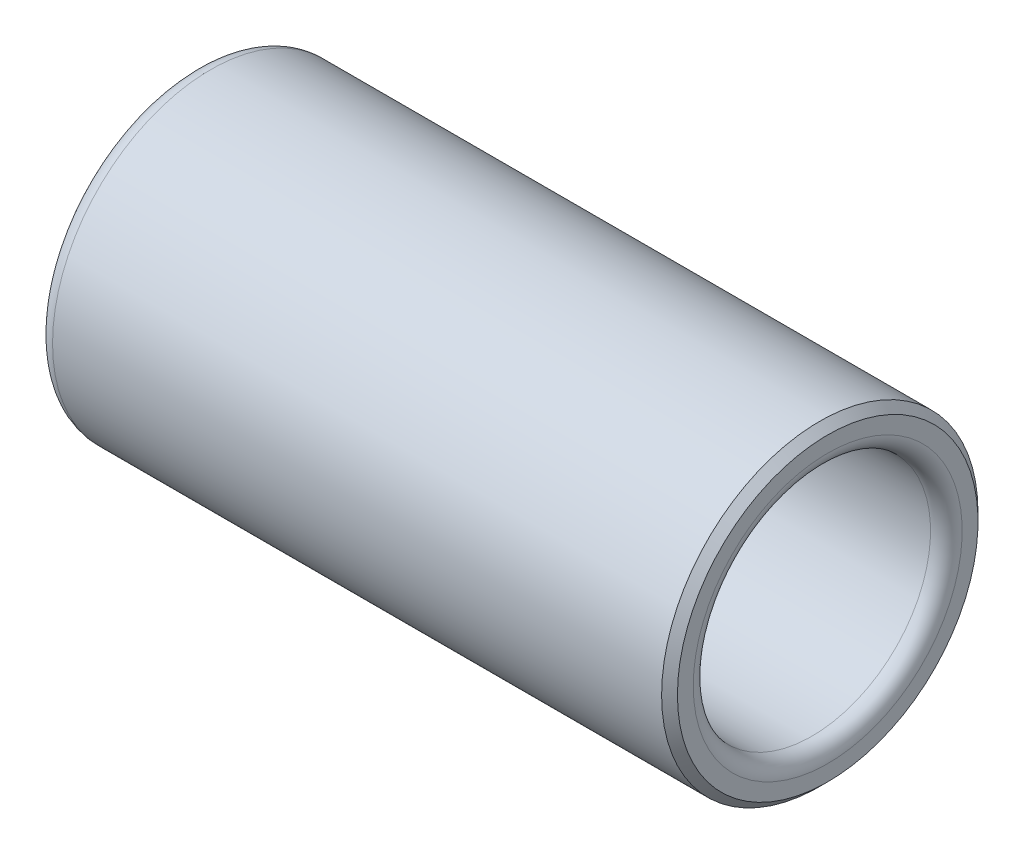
ISO-10303-21;
HEADER;
FILE_DESCRIPTION(('STEP AP214'),'2;1');
FILE_NAME('part.step','',(''),(''),'','','');
FILE_SCHEMA(('AUTOMOTIVE_DESIGN { 1 0 10303 214 1 1 1 1 }'));
ENDSEC;
DATA;
#1=APPLICATION_CONTEXT('core data for automotive mechanical design processes');
#2=APPLICATION_PROTOCOL_DEFINITION('international standard','automotive_design',2000,#1);
#3=PRODUCT_CONTEXT('',#1,'mechanical');
#4=PRODUCT('Part','Part','',(#3));
#5=PRODUCT_RELATED_PRODUCT_CATEGORY('part','',(#4));
#6=PRODUCT_DEFINITION_FORMATION('','',#4);
#7=PRODUCT_DEFINITION_CONTEXT('part definition',#1,'design');
#8=PRODUCT_DEFINITION('design','',#6,#7);
#9=PRODUCT_DEFINITION_SHAPE('','',#8);
#10=(LENGTH_UNIT() NAMED_UNIT(*) SI_UNIT(.MILLI.,.METRE.));
#11=(NAMED_UNIT(*) PLANE_ANGLE_UNIT() SI_UNIT($,.RADIAN.));
#12=(NAMED_UNIT(*) SI_UNIT($,.STERADIAN.) SOLID_ANGLE_UNIT());
#13=UNCERTAINTY_MEASURE_WITH_UNIT(LENGTH_MEASURE(1.E-05),#10,'distance_accuracy_value','');
#14=(GEOMETRIC_REPRESENTATION_CONTEXT(3) GLOBAL_UNCERTAINTY_ASSIGNED_CONTEXT((#13)) GLOBAL_UNIT_ASSIGNED_CONTEXT((#10,
#11,#12)) REPRESENTATION_CONTEXT('',''));
#15=CARTESIAN_POINT('',(0.,0.,0.));
#16=DIRECTION('',(0.,0.,1.));
#17=DIRECTION('',(1.,0.,0.));
#18=AXIS2_PLACEMENT_3D('',#15,#16,#17);
#19=CARTESIAN_POINT('',(-64.6395024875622,0.,0.));
#20=DIRECTION('',(-1.,0.,0.));
#21=DIRECTION('',(0.,0.,1.));
#22=AXIS2_PLACEMENT_3D('',#19,#20,#21);
#23=CYLINDRICAL_SURFACE('',#22,10.);
#24=CARTESIAN_POINT('',(1.,0.,0.));
#25=DIRECTION('',(1.,0.,0.));
#26=DIRECTION('',(0.,0.,-1.));
#27=AXIS2_PLACEMENT_3D('',#24,#25,#26);
#28=CIRCLE('',#27,10.);
#29=CARTESIAN_POINT('',(1.,0.,-10.));
#30=VERTEX_POINT('',#29);
#31=EDGE_CURVE('E42',#30,#30,#28,.T.);
#32=ORIENTED_EDGE('',*,*,#31,.T.);
#33=EDGE_LOOP('',(#32));
#34=FACE_BOUND('',#33,.T.);
#35=CARTESIAN_POINT('',(39.5,0.,0.));
#36=DIRECTION('',(-1.,0.,0.));
#37=DIRECTION('',(0.,0.,1.));
#38=AXIS2_PLACEMENT_3D('',#35,#36,#37);
#39=CIRCLE('',#38,10.);
#40=CARTESIAN_POINT('',(39.5,0.,10.));
#41=VERTEX_POINT('',#40);
#42=EDGE_CURVE('E54',#41,#41,#39,.T.);
#43=ORIENTED_EDGE('',*,*,#42,.T.);
#44=EDGE_LOOP('',(#43));
#45=FACE_BOUND('',#44,.T.);
#46=ADVANCED_FACE('F31',(#34,#45),#23,.T.);
#47=CARTESIAN_POINT('',(40.,10.,0.));
#48=DIRECTION('',(-1.,0.,0.));
#49=DIRECTION('',(0.,0.,1.));
#50=AXIS2_PLACEMENT_3D('',#47,#48,#49);
#51=PLANE('',#50);
#52=CARTESIAN_POINT('',(40.,0.,0.));
#53=DIRECTION('',(-1.,0.,0.));
#54=DIRECTION('',(0.,0.,1.));
#55=AXIS2_PLACEMENT_3D('',#52,#53,#54);
#56=CIRCLE('',#55,8.5);
#57=CARTESIAN_POINT('',(40.,0.,8.5));
#58=VERTEX_POINT('',#57);
#59=EDGE_CURVE('E38',#58,#58,#56,.T.);
#60=ORIENTED_EDGE('',*,*,#59,.T.);
#61=EDGE_LOOP('',(#60));
#62=FACE_BOUND('',#61,.T.);
#63=CARTESIAN_POINT('',(40.,0.,0.));
#64=DIRECTION('',(-1.,0.,0.));
#65=DIRECTION('',(0.,0.,1.));
#66=AXIS2_PLACEMENT_3D('',#63,#64,#65);
#67=CIRCLE('',#66,9.50000000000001);
#68=CARTESIAN_POINT('',(40.,0.,9.50000000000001));
#69=VERTEX_POINT('',#68);
#70=EDGE_CURVE('E51',#69,#69,#67,.F.);
#71=ORIENTED_EDGE('',*,*,#70,.T.);
#72=EDGE_LOOP('',(#71));
#73=FACE_BOUND('',#72,.T.);
#74=ADVANCED_FACE('F85',(#62,#73),#51,.F.);
#75=CARTESIAN_POINT('',(-64.6395024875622,0.,0.));
#76=DIRECTION('',(-1.,0.,0.));
#77=DIRECTION('',(0.,0.,1.));
#78=AXIS2_PLACEMENT_3D('',#75,#76,#77);
#79=CYLINDRICAL_SURFACE('',#78,7.5);
#80=CARTESIAN_POINT('',(39.,0.,0.));
#81=DIRECTION('',(-1.,0.,0.));
#82=DIRECTION('',(0.,0.,1.));
#83=AXIS2_PLACEMENT_3D('',#80,#81,#82);
#84=CIRCLE('',#83,7.5);
#85=CARTESIAN_POINT('',(39.,0.,7.5));
#86=VERTEX_POINT('',#85);
#87=EDGE_CURVE('E10',#86,#86,#84,.F.);
#88=ORIENTED_EDGE('',*,*,#87,.T.);
#89=EDGE_LOOP('',(#88));
#90=FACE_BOUND('',#89,.T.);
#91=CARTESIAN_POINT('',(7.59807621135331,0.,0.));
#92=DIRECTION('',(-1.,0.,0.));
#93=DIRECTION('',(0.,0.,1.));
#94=AXIS2_PLACEMENT_3D('',#91,#92,#93);
#95=CIRCLE('',#94,7.5);
#96=CARTESIAN_POINT('',(7.59807621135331,0.,7.5));
#97=VERTEX_POINT('',#96);
#98=EDGE_CURVE('E57',#97,#97,#95,.T.);
#99=ORIENTED_EDGE('',*,*,#98,.T.);
#100=EDGE_LOOP('',(#99));
#101=FACE_BOUND('',#100,.T.);
#102=ADVANCED_FACE('F91',(#90,#101),#79,.F.);
#103=CARTESIAN_POINT('',(5.,0.,0.));
#104=DIRECTION('',(1.,0.,0.));
#105=DIRECTION('',(0.,0.,-1.));
#106=AXIS2_PLACEMENT_3D('',#103,#104,#105);
#107=CONICAL_SURFACE('',#106,6.,0.5235987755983);
#108=ORIENTED_EDGE('',*,*,#98,.F.);
#109=EDGE_LOOP('',(#108));
#110=FACE_BOUND('',#109,.T.);
#111=CARTESIAN_POINT('',(5.,0.,0.));
#112=DIRECTION('',(-1.,0.,0.));
#113=DIRECTION('',(0.,0.,1.));
#114=AXIS2_PLACEMENT_3D('',#111,#112,#113);
#115=CIRCLE('',#114,6.);
#116=CARTESIAN_POINT('',(5.,0.,6.));
#117=VERTEX_POINT('',#116);
#118=EDGE_CURVE('E60',#117,#117,#115,.T.);
#119=ORIENTED_EDGE('',*,*,#118,.T.);
#120=EDGE_LOOP('',(#119));
#121=FACE_BOUND('',#120,.T.);
#122=ADVANCED_FACE('F81',(#110,#121),#107,.F.);
#123=CARTESIAN_POINT('',(-64.6395024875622,0.,0.));
#124=DIRECTION('',(-1.,0.,0.));
#125=DIRECTION('',(0.,0.,1.));
#126=AXIS2_PLACEMENT_3D('',#123,#124,#125);
#127=CYLINDRICAL_SURFACE('',#126,6.);
#128=ORIENTED_EDGE('',*,*,#118,.F.);
#129=EDGE_LOOP('',(#128));
#130=FACE_BOUND('',#129,.T.);
#131=CARTESIAN_POINT('',(0.,0.,0.));
#132=DIRECTION('',(-1.,0.,0.));
#133=DIRECTION('',(0.,0.,1.));
#134=AXIS2_PLACEMENT_3D('',#131,#132,#133);
#135=CIRCLE('',#134,6.);
#136=CARTESIAN_POINT('',(0.,0.,6.));
#137=VERTEX_POINT('',#136);
#138=EDGE_CURVE('E63',#137,#137,#135,.T.);
#139=ORIENTED_EDGE('',*,*,#138,.T.);
#140=EDGE_LOOP('',(#139));
#141=FACE_BOUND('',#140,.T.);
#142=ADVANCED_FACE('F67',(#130,#141),#127,.F.);
#143=CARTESIAN_POINT('',(0.,6.,0.));
#144=DIRECTION('',(1.,0.,0.));
#145=DIRECTION('',(0.,0.,-1.));
#146=AXIS2_PLACEMENT_3D('',#143,#144,#145);
#147=PLANE('',#146);
#148=CARTESIAN_POINT('',(0.,0.,0.));
#149=DIRECTION('',(1.,0.,0.));
#150=DIRECTION('',(0.,0.,-1.));
#151=AXIS2_PLACEMENT_3D('',#148,#149,#150);
#152=CIRCLE('',#151,9.);
#153=CARTESIAN_POINT('',(0.,0.,-9.));
#154=VERTEX_POINT('',#153);
#155=EDGE_CURVE('E46',#154,#154,#152,.F.);
#156=ORIENTED_EDGE('',*,*,#155,.T.);
#157=EDGE_LOOP('',(#156));
#158=FACE_BOUND('',#157,.T.);
#159=ORIENTED_EDGE('',*,*,#138,.F.);
#160=EDGE_LOOP('',(#159));
#161=FACE_BOUND('',#160,.T.);
#162=ADVANCED_FACE('F69',(#158,#161),#147,.F.);
#163=CARTESIAN_POINT('',(39.5,0.,0.));
#164=DIRECTION('',(-1.,0.,0.));
#165=DIRECTION('',(0.,0.,1.));
#166=AXIS2_PLACEMENT_3D('',#163,#164,#165);
#167=CONICAL_SURFACE('',#166,10.,0.785398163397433);
#168=ORIENTED_EDGE('',*,*,#70,.F.);
#169=EDGE_LOOP('',(#168));
#170=FACE_BOUND('',#169,.T.);
#171=ORIENTED_EDGE('',*,*,#42,.F.);
#172=EDGE_LOOP('',(#171));
#173=FACE_BOUND('',#172,.T.);
#174=ADVANCED_FACE('F71',(#170,#173),#167,.T.);
#175=CARTESIAN_POINT('',(1.,0.,0.));
#176=DIRECTION('',(1.,0.,0.));
#177=DIRECTION('',(0.,0.,-1.));
#178=AXIS2_PLACEMENT_3D('',#175,#176,#177);
#179=TOROIDAL_SURFACE('',#178,9.,1.);
#180=ORIENTED_EDGE('',*,*,#31,.F.);
#181=EDGE_LOOP('',(#180));
#182=FACE_BOUND('',#181,.T.);
#183=ORIENTED_EDGE('',*,*,#155,.F.);
#184=EDGE_LOOP('',(#183));
#185=FACE_BOUND('',#184,.T.);
#186=ADVANCED_FACE('F78',(#182,#185),#179,.T.);
#187=CARTESIAN_POINT('',(39.,0.,0.));
#188=DIRECTION('',(-1.,0.,0.));
#189=DIRECTION('',(0.,0.,1.));
#190=AXIS2_PLACEMENT_3D('',#187,#188,#189);
#191=TOROIDAL_SURFACE('',#190,8.5,1.);
#192=ORIENTED_EDGE('',*,*,#87,.F.);
#193=EDGE_LOOP('',(#192));
#194=FACE_BOUND('',#193,.T.);
#195=ORIENTED_EDGE('',*,*,#59,.F.);
#196=EDGE_LOOP('',(#195));
#197=FACE_BOUND('',#196,.T.);
#198=ADVANCED_FACE('F33',(#194,#197),#191,.T.);
#199=CLOSED_SHELL('',(#46,#74,#102,#122,#142,#162,#174,#186,#198));
#200=MANIFOLD_SOLID_BREP('B2',#199);
#201=ADVANCED_BREP_SHAPE_REPRESENTATION('',(#18,#200),#14);
#202=SHAPE_DEFINITION_REPRESENTATION(#9,#201);
ENDSEC;
END-ISO-10303-21;
